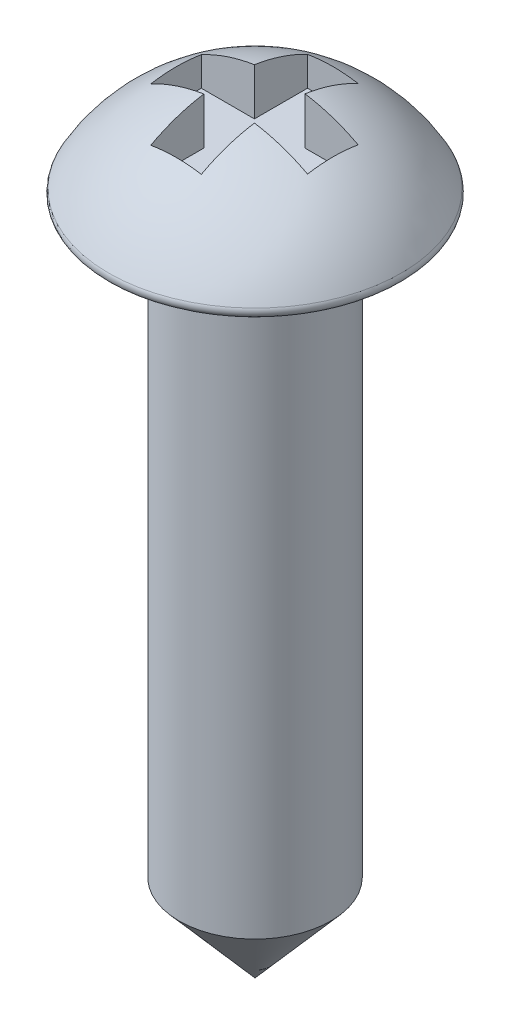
ISO-10303-21;
HEADER;
FILE_DESCRIPTION(('STEP AP214'),'2;1');
FILE_NAME('part.step','',(''),(''),'','','');
FILE_SCHEMA(('AUTOMOTIVE_DESIGN { 1 0 10303 214 1 1 1 1 }'));
ENDSEC;
DATA;
#1=APPLICATION_CONTEXT('core data for automotive mechanical design processes');
#2=APPLICATION_PROTOCOL_DEFINITION('international standard','automotive_design',2000,#1);
#3=PRODUCT_CONTEXT('',#1,'mechanical');
#4=PRODUCT('Part','Part','',(#3));
#5=PRODUCT_RELATED_PRODUCT_CATEGORY('part','',(#4));
#6=PRODUCT_DEFINITION_FORMATION('','',#4);
#7=PRODUCT_DEFINITION_CONTEXT('part definition',#1,'design');
#8=PRODUCT_DEFINITION('design','',#6,#7);
#9=PRODUCT_DEFINITION_SHAPE('','',#8);
#10=(LENGTH_UNIT() NAMED_UNIT(*) SI_UNIT(.MILLI.,.METRE.));
#11=(NAMED_UNIT(*) PLANE_ANGLE_UNIT() SI_UNIT($,.RADIAN.));
#12=(NAMED_UNIT(*) SI_UNIT($,.STERADIAN.) SOLID_ANGLE_UNIT());
#13=UNCERTAINTY_MEASURE_WITH_UNIT(LENGTH_MEASURE(1.E-05),#10,'distance_accuracy_value','');
#14=(GEOMETRIC_REPRESENTATION_CONTEXT(3) GLOBAL_UNCERTAINTY_ASSIGNED_CONTEXT((#13)) GLOBAL_UNIT_ASSIGNED_CONTEXT((#10,
#11,#12)) REPRESENTATION_CONTEXT('',''));
#15=CARTESIAN_POINT('',(0.,0.,0.));
#16=DIRECTION('',(0.,0.,1.));
#17=DIRECTION('',(1.,0.,0.));
#18=AXIS2_PLACEMENT_3D('',#15,#16,#17);
#19=CARTESIAN_POINT('',(0.,-9.7655291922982,0.));
#20=DIRECTION('',(0.,1.,0.));
#21=DIRECTION('',(0.,0.,1.));
#22=AXIS2_PLACEMENT_3D('',#19,#20,#21);
#23=CONICAL_SURFACE('',#22,0.,0.715536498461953);
#24=CARTESIAN_POINT('',(0.,-8.5,0.));
#25=DIRECTION('',(0.,1.,0.));
#26=DIRECTION('',(0.,0.,1.));
#27=AXIS2_PLACEMENT_3D('',#24,#25,#26);
#28=CIRCLE('',#27,1.1);
#29=CARTESIAN_POINT('',(0.,-8.5,1.1));
#30=VERTEX_POINT('',#29);
#31=EDGE_CURVE('E205',#30,#30,#28,.T.);
#32=ORIENTED_EDGE('',*,*,#31,.F.);
#33=EDGE_LOOP('',(#32));
#34=FACE_BOUND('',#33,.T.);
#35=CARTESIAN_POINT('',(0.,-9.7655291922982,0.));
#36=VERTEX_POINT('',#35);
#37=VERTEX_LOOP('',#36);
#38=FACE_BOUND('',#37,.T.);
#39=ADVANCED_FACE('F37',(#34,#38),#23,.T.);
#40=CARTESIAN_POINT('',(0.,3.8000547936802,0.));
#41=DIRECTION('',(0.,1.,0.));
#42=DIRECTION('',(0.,0.,1.));
#43=AXIS2_PLACEMENT_3D('',#40,#41,#42);
#44=CYLINDRICAL_SURFACE('',#43,1.1);
#45=CARTESIAN_POINT('',(0.,0.,0.));
#46=DIRECTION('',(0.,1.,0.));
#47=DIRECTION('',(0.,0.,1.));
#48=AXIS2_PLACEMENT_3D('',#45,#46,#47);
#49=CIRCLE('',#48,1.1);
#50=CARTESIAN_POINT('',(0.,0.,1.1));
#51=VERTEX_POINT('',#50);
#52=EDGE_CURVE('E174',#51,#51,#49,.T.);
#53=ORIENTED_EDGE('',*,*,#52,.F.);
#54=EDGE_LOOP('',(#53));
#55=FACE_BOUND('',#54,.T.);
#56=ORIENTED_EDGE('',*,*,#31,.T.);
#57=EDGE_LOOP('',(#56));
#58=FACE_BOUND('',#57,.T.);
#59=ADVANCED_FACE('F283',(#55,#58),#44,.T.);
#60=CARTESIAN_POINT('',(2.2,0.,0.));
#61=DIRECTION('',(0.,1.,0.));
#62=DIRECTION('',(0.,0.,1.));
#63=AXIS2_PLACEMENT_3D('',#60,#61,#62);
#64=PLANE('',#63);
#65=CARTESIAN_POINT('',(0.,0.,0.));
#66=DIRECTION('',(0.,1.,0.));
#67=DIRECTION('',(0.,0.,1.));
#68=AXIS2_PLACEMENT_3D('',#65,#66,#67);
#69=CIRCLE('',#68,2.0359463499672);
#70=CARTESIAN_POINT('',(0.,0.,2.0359463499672));
#71=VERTEX_POINT('',#70);
#72=EDGE_CURVE('E211',#71,#71,#69,.F.);
#73=ORIENTED_EDGE('',*,*,#72,.T.);
#74=EDGE_LOOP('',(#73));
#75=FACE_BOUND('',#74,.T.);
#76=ORIENTED_EDGE('',*,*,#52,.T.);
#77=EDGE_LOOP('',(#76));
#78=FACE_BOUND('',#77,.T.);
#79=ADVANCED_FACE('F288',(#75,#78),#64,.F.);
#80=CARTESIAN_POINT('',(0.,-1.04082556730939,0.));
#81=DIRECTION('',(0.,1.,0.));
#82=DIRECTION('',(1.,0.,0.));
#83=AXIS2_PLACEMENT_3D('',#80,#81,#82);
#84=SPHERICAL_SURFACE('',#83,2.43378673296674);
#85=CARTESIAN_POINT('',(0.,-1.04082556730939,0.370388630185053));
#86=DIRECTION('',(0.,0.,1.));
#87=DIRECTION('',(1.,0.,0.));
#88=AXIS2_PLACEMENT_3D('',#85,#86,#87);
#89=CIRCLE('',#88,2.40543761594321);
#90=CARTESIAN_POINT('',(1.13232028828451,1.08143287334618,0.370388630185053));
#91=VERTEX_POINT('',#90);
#92=CARTESIAN_POINT('',(0.361948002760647,1.33722484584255,0.370388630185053));
#93=VERTEX_POINT('',#92);
#94=EDGE_CURVE('E214',#91,#93,#89,.T.);
#95=ORIENTED_EDGE('',*,*,#94,.T.);
#96=CARTESIAN_POINT('',(0.361948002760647,-1.04082556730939,0.));
#97=DIRECTION('',(1.,0.,0.));
#98=DIRECTION('',(0.,0.,-1.));
#99=AXIS2_PLACEMENT_3D('',#96,#97,#98);
#100=CIRCLE('',#99,2.40672214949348);
#101=CARTESIAN_POINT('',(0.361948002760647,1.07836674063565,1.14076091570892));
#102=VERTEX_POINT('',#101);
#103=EDGE_CURVE('E11',#93,#102,#100,.T.);
#104=ORIENTED_EDGE('',*,*,#103,.T.);
#105=CARTESIAN_POINT('',(0.,-1.04082556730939,1.14076091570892));
#106=DIRECTION('',(0.,0.,1.));
#107=DIRECTION('',(1.,0.,0.));
#108=AXIS2_PLACEMENT_3D('',#105,#106,#107);
#109=CIRCLE('',#108,2.14987962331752);
#110=CARTESIAN_POINT('',(-0.371599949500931,1.07669559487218,1.14076091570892));
#111=VERTEX_POINT('',#110);
#112=EDGE_CURVE('E44',#102,#111,#109,.T.);
#113=ORIENTED_EDGE('',*,*,#112,.T.);
#114=CARTESIAN_POINT('',(-0.371599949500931,-1.04082556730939,0.));
#115=DIRECTION('',(-1.,0.,0.));
#116=DIRECTION('',(0.,0.,1.));
#117=AXIS2_PLACEMENT_3D('',#114,#115,#116);
#118=CIRCLE('',#117,2.40525078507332);
#119=CARTESIAN_POINT('',(-0.371599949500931,1.3357357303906,0.370388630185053));
#120=VERTEX_POINT('',#119);
#121=EDGE_CURVE('E240',#111,#120,#118,.T.);
#122=ORIENTED_EDGE('',*,*,#121,.T.);
#123=CARTESIAN_POINT('',(0.,-1.04082556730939,0.370388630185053));
#124=DIRECTION('',(0.,0.,1.));
#125=DIRECTION('',(1.,0.,0.));
#126=AXIS2_PLACEMENT_3D('',#123,#124,#125);
#127=CIRCLE('',#126,2.40543761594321);
#128=CARTESIAN_POINT('',(-1.14197223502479,1.07625486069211,0.370388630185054));
#129=VERTEX_POINT('',#128);
#130=EDGE_CURVE('E237',#120,#129,#127,.T.);
#131=ORIENTED_EDGE('',*,*,#130,.T.);
#132=CARTESIAN_POINT('',(-1.14197223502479,-1.04082556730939,0.));
#133=DIRECTION('',(-1.,0.,0.));
#134=DIRECTION('',(0.,0.,1.));
#135=AXIS2_PLACEMENT_3D('',#132,#133,#134);
#136=CIRCLE('',#135,2.14923644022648);
#137=CARTESIAN_POINT('',(-1.14197223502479,1.07750693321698,-0.363159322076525));
#138=VERTEX_POINT('',#137);
#139=EDGE_CURVE('E234',#129,#138,#136,.T.);
#140=ORIENTED_EDGE('',*,*,#139,.T.);
#141=CARTESIAN_POINT('',(0.,-1.04082556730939,-0.363159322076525));
#142=DIRECTION('',(0.,0.,-1.));
#143=DIRECTION('',(-1.,0.,0.));
#144=AXIS2_PLACEMENT_3D('',#141,#142,#143);
#145=CIRCLE('',#144,2.40653966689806);
#146=CARTESIAN_POINT('',(-0.371599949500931,1.33685116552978,-0.363159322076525));
#147=VERTEX_POINT('',#146);
#148=EDGE_CURVE('E231',#138,#147,#145,.T.);
#149=ORIENTED_EDGE('',*,*,#148,.T.);
#150=CARTESIAN_POINT('',(-0.371599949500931,-1.04082556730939,0.));
#151=DIRECTION('',(-1.,0.,0.));
#152=DIRECTION('',(0.,0.,1.));
#153=AXIS2_PLACEMENT_3D('',#150,#151,#152);
#154=CIRCLE('',#153,2.40525078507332);
#155=CARTESIAN_POINT('',(-0.371599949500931,1.08057430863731,-1.13353160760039));
#156=VERTEX_POINT('',#155);
#157=EDGE_CURVE('E228',#147,#156,#154,.T.);
#158=ORIENTED_EDGE('',*,*,#157,.T.);
#159=CARTESIAN_POINT('',(0.,-1.04082556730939,-1.13353160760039));
#160=DIRECTION('',(0.,0.,-1.));
#161=DIRECTION('',(-1.,0.,0.));
#162=AXIS2_PLACEMENT_3D('',#159,#160,#161);
#163=CIRCLE('',#162,2.15370006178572);
#164=CARTESIAN_POINT('',(0.361948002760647,1.08224240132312,-1.13353160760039));
#165=VERTEX_POINT('',#164);
#166=EDGE_CURVE('E225',#156,#165,#163,.T.);
#167=ORIENTED_EDGE('',*,*,#166,.T.);
#168=CARTESIAN_POINT('',(0.361948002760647,-1.04082556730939,0.));
#169=DIRECTION('',(1.,0.,0.));
#170=DIRECTION('',(0.,0.,-1.));
#171=AXIS2_PLACEMENT_3D('',#168,#169,#170);
#172=CIRCLE('',#171,2.40672214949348);
#173=CARTESIAN_POINT('',(0.361948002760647,1.33833958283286,-0.363159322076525));
#174=VERTEX_POINT('',#173);
#175=EDGE_CURVE('E222',#165,#174,#172,.T.);
#176=ORIENTED_EDGE('',*,*,#175,.T.);
#177=CARTESIAN_POINT('',(0.,-1.04082556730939,-0.363159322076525));
#178=DIRECTION('',(0.,0.,-1.));
#179=DIRECTION('',(-1.,0.,0.));
#180=AXIS2_PLACEMENT_3D('',#177,#178,#179);
#181=CIRCLE('',#180,2.40653966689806);
#182=CARTESIAN_POINT('',(1.13232028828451,1.0826818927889,-0.363159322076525));
#183=VERTEX_POINT('',#182);
#184=EDGE_CURVE('E219',#174,#183,#181,.T.);
#185=ORIENTED_EDGE('',*,*,#184,.T.);
#186=CARTESIAN_POINT('',(1.13232028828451,-1.04082556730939,0.));
#187=DIRECTION('',(1.,0.,0.));
#188=DIRECTION('',(0.,0.,-1.));
#189=AXIS2_PLACEMENT_3D('',#186,#187,#188);
#190=CIRCLE('',#189,2.15433716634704);
#191=EDGE_CURVE('E216',#183,#91,#190,.T.);
#192=ORIENTED_EDGE('',*,*,#191,.T.);
#193=EDGE_LOOP('',(#95,#104,#113,#122,#131,#140,#149,#158,#167,#176,#185,#192));
#194=FACE_BOUND('',#193,.T.);
#195=CARTESIAN_POINT('',(0.,0.148883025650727,0.));
#196=DIRECTION('',(0.,-1.,0.));
#197=DIRECTION('',(0.,0.,-1.));
#198=AXIS2_PLACEMENT_3D('',#195,#196,#197);
#199=CIRCLE('',#198,2.12318424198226);
#200=CARTESIAN_POINT('',(0.,0.148883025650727,-2.12318424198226));
#201=VERTEX_POINT('',#200);
#202=EDGE_CURVE('E208',#201,#201,#199,.F.);
#203=ORIENTED_EDGE('',*,*,#202,.T.);
#204=EDGE_LOOP('',(#203));
#205=FACE_BOUND('',#204,.T.);
#206=ADVANCED_FACE('F244',(#194,#205),#84,.T.);
#207=CARTESIAN_POINT('',(0.,0.1,0.));
#208=DIRECTION('',(0.,1.,0.));
#209=DIRECTION('',(0.,0.,1.));
#210=AXIS2_PLACEMENT_3D('',#207,#208,#209);
#211=TOROIDAL_SURFACE('',#210,2.0359463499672,0.1);
#212=ORIENTED_EDGE('',*,*,#72,.F.);
#213=EDGE_LOOP('',(#212));
#214=FACE_BOUND('',#213,.T.);
#215=ORIENTED_EDGE('',*,*,#202,.F.);
#216=EDGE_LOOP('',(#215));
#217=FACE_BOUND('',#216,.T.);
#218=ADVANCED_FACE('F301',(#214,#217),#211,.T.);
#219=CARTESIAN_POINT('',(0.361948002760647,0.656537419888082,1.14076091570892));
#220=DIRECTION('',(1.,0.,0.));
#221=DIRECTION('',(0.,0.,-1.));
#222=AXIS2_PLACEMENT_3D('',#219,#220,#221);
#223=PLANE('',#222);
#224=DIRECTION('',(0.,1.,0.));
#225=VECTOR('',#224,1.);
#226=CARTESIAN_POINT('',(0.361948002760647,0.656537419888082,0.370388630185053));
#227=LINE('',#226,#225);
#228=CARTESIAN_POINT('',(0.361948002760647,0.656537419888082,0.370388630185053));
#229=VERTEX_POINT('',#228);
#230=EDGE_CURVE('E51',#229,#93,#227,.T.);
#231=ORIENTED_EDGE('',*,*,#230,.F.);
#232=DIRECTION('',(0.,0.,-1.));
#233=VECTOR('',#232,1.);
#234=CARTESIAN_POINT('',(0.361948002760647,0.656537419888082,1.14076091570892));
#235=LINE('',#234,#233);
#236=CARTESIAN_POINT('',(0.361948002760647,0.656537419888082,1.14076091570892));
#237=VERTEX_POINT('',#236);
#238=EDGE_CURVE('E127',#237,#229,#235,.T.);
#239=ORIENTED_EDGE('',*,*,#238,.F.);
#240=DIRECTION('',(0.,1.,0.));
#241=VECTOR('',#240,1.);
#242=CARTESIAN_POINT('',(0.361948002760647,0.656537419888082,1.14076091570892));
#243=LINE('',#242,#241);
#244=EDGE_CURVE('E172',#237,#102,#243,.T.);
#245=ORIENTED_EDGE('',*,*,#244,.T.);
#246=ORIENTED_EDGE('',*,*,#103,.F.);
#247=EDGE_LOOP('',(#231,#239,#245,#246));
#248=FACE_BOUND('',#247,.T.);
#249=ADVANCED_FACE('F124',(#248),#223,.F.);
#250=CARTESIAN_POINT('',(0.361948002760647,0.656537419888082,1.14076091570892));
#251=DIRECTION('',(0.,0.,1.));
#252=DIRECTION('',(1.,0.,0.));
#253=AXIS2_PLACEMENT_3D('',#250,#251,#252);
#254=PLANE('',#253);
#255=ORIENTED_EDGE('',*,*,#244,.F.);
#256=DIRECTION('',(1.,0.,0.));
#257=VECTOR('',#256,1.);
#258=CARTESIAN_POINT('',(0.361948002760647,0.656537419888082,1.14076091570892));
#259=LINE('',#258,#257);
#260=CARTESIAN_POINT('',(-0.371599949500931,0.656537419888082,1.14076091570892));
#261=VERTEX_POINT('',#260);
#262=EDGE_CURVE('E131',#261,#237,#259,.T.);
#263=ORIENTED_EDGE('',*,*,#262,.F.);
#264=DIRECTION('',(0.,1.,0.));
#265=VECTOR('',#264,1.);
#266=CARTESIAN_POINT('',(-0.371599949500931,0.656537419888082,1.14076091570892));
#267=LINE('',#266,#265);
#268=EDGE_CURVE('E175',#261,#111,#267,.T.);
#269=ORIENTED_EDGE('',*,*,#268,.T.);
#270=ORIENTED_EDGE('',*,*,#112,.F.);
#271=EDGE_LOOP('',(#255,#263,#269,#270));
#272=FACE_BOUND('',#271,.T.);
#273=ADVANCED_FACE('F247',(#272),#254,.F.);
#274=CARTESIAN_POINT('',(-0.371599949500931,0.656537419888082,1.14076091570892));
#275=DIRECTION('',(-1.,0.,0.));
#276=DIRECTION('',(0.,0.,1.));
#277=AXIS2_PLACEMENT_3D('',#274,#275,#276);
#278=PLANE('',#277);
#279=ORIENTED_EDGE('',*,*,#268,.F.);
#280=DIRECTION('',(0.,0.,1.));
#281=VECTOR('',#280,1.);
#282=CARTESIAN_POINT('',(-0.371599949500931,0.656537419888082,1.14076091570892));
#283=LINE('',#282,#281);
#284=CARTESIAN_POINT('',(-0.371599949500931,0.656537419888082,0.370388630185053));
#285=VERTEX_POINT('',#284);
#286=EDGE_CURVE('E169',#285,#261,#283,.T.);
#287=ORIENTED_EDGE('',*,*,#286,.F.);
#288=DIRECTION('',(0.,1.,0.));
#289=VECTOR('',#288,1.);
#290=CARTESIAN_POINT('',(-0.371599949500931,0.656537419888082,0.370388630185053));
#291=LINE('',#290,#289);
#292=EDGE_CURVE('E178',#285,#120,#291,.T.);
#293=ORIENTED_EDGE('',*,*,#292,.T.);
#294=ORIENTED_EDGE('',*,*,#121,.F.);
#295=EDGE_LOOP('',(#279,#287,#293,#294));
#296=FACE_BOUND('',#295,.T.);
#297=ADVANCED_FACE('F250',(#296),#278,.F.);
#298=CARTESIAN_POINT('',(-0.371599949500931,0.656537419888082,0.370388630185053));
#299=DIRECTION('',(0.,0.,1.));
#300=DIRECTION('',(1.,0.,0.));
#301=AXIS2_PLACEMENT_3D('',#298,#299,#300);
#302=PLANE('',#301);
#303=ORIENTED_EDGE('',*,*,#292,.F.);
#304=DIRECTION('',(1.,0.,0.));
#305=VECTOR('',#304,1.);
#306=CARTESIAN_POINT('',(-0.371599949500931,0.656537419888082,0.370388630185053));
#307=LINE('',#306,#305);
#308=CARTESIAN_POINT('',(-1.14197223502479,0.656537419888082,0.370388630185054));
#309=VERTEX_POINT('',#308);
#310=EDGE_CURVE('E166',#309,#285,#307,.T.);
#311=ORIENTED_EDGE('',*,*,#310,.F.);
#312=DIRECTION('',(0.,1.,0.));
#313=VECTOR('',#312,1.);
#314=CARTESIAN_POINT('',(-1.14197223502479,0.656537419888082,0.370388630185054));
#315=LINE('',#314,#313);
#316=EDGE_CURVE('E181',#309,#129,#315,.T.);
#317=ORIENTED_EDGE('',*,*,#316,.T.);
#318=ORIENTED_EDGE('',*,*,#130,.F.);
#319=EDGE_LOOP('',(#303,#311,#317,#318));
#320=FACE_BOUND('',#319,.T.);
#321=ADVANCED_FACE('F254',(#320),#302,.F.);
#322=CARTESIAN_POINT('',(-1.14197223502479,0.656537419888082,0.370388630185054));
#323=DIRECTION('',(-1.,0.,0.));
#324=DIRECTION('',(0.,0.,1.));
#325=AXIS2_PLACEMENT_3D('',#322,#323,#324);
#326=PLANE('',#325);
#327=ORIENTED_EDGE('',*,*,#316,.F.);
#328=DIRECTION('',(0.,0.,1.));
#329=VECTOR('',#328,1.);
#330=CARTESIAN_POINT('',(-1.14197223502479,0.656537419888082,0.370388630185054));
#331=LINE('',#330,#329);
#332=CARTESIAN_POINT('',(-1.14197223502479,0.656537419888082,-0.363159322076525));
#333=VERTEX_POINT('',#332);
#334=EDGE_CURVE('E163',#333,#309,#331,.T.);
#335=ORIENTED_EDGE('',*,*,#334,.F.);
#336=DIRECTION('',(0.,1.,0.));
#337=VECTOR('',#336,1.);
#338=CARTESIAN_POINT('',(-1.14197223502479,0.656537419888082,-0.363159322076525));
#339=LINE('',#338,#337);
#340=EDGE_CURVE('E184',#333,#138,#339,.T.);
#341=ORIENTED_EDGE('',*,*,#340,.T.);
#342=ORIENTED_EDGE('',*,*,#139,.F.);
#343=EDGE_LOOP('',(#327,#335,#341,#342));
#344=FACE_BOUND('',#343,.T.);
#345=ADVANCED_FACE('F256',(#344),#326,.F.);
#346=CARTESIAN_POINT('',(-0.371599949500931,0.656537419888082,-0.363159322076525));
#347=DIRECTION('',(0.,0.,-1.));
#348=DIRECTION('',(-1.,0.,0.));
#349=AXIS2_PLACEMENT_3D('',#346,#347,#348);
#350=PLANE('',#349);
#351=ORIENTED_EDGE('',*,*,#340,.F.);
#352=DIRECTION('',(-1.,0.,0.));
#353=VECTOR('',#352,1.);
#354=CARTESIAN_POINT('',(-0.371599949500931,0.656537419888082,-0.363159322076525));
#355=LINE('',#354,#353);
#356=CARTESIAN_POINT('',(-0.371599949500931,0.656537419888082,-0.363159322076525));
#357=VERTEX_POINT('',#356);
#358=EDGE_CURVE('E160',#357,#333,#355,.T.);
#359=ORIENTED_EDGE('',*,*,#358,.F.);
#360=DIRECTION('',(0.,1.,0.));
#361=VECTOR('',#360,1.);
#362=CARTESIAN_POINT('',(-0.371599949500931,0.656537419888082,-0.363159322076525));
#363=LINE('',#362,#361);
#364=EDGE_CURVE('E187',#357,#147,#363,.T.);
#365=ORIENTED_EDGE('',*,*,#364,.T.);
#366=ORIENTED_EDGE('',*,*,#148,.F.);
#367=EDGE_LOOP('',(#351,#359,#365,#366));
#368=FACE_BOUND('',#367,.T.);
#369=ADVANCED_FACE('F259',(#368),#350,.F.);
#370=CARTESIAN_POINT('',(-0.371599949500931,0.656537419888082,-0.363159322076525));
#371=DIRECTION('',(-1.,0.,0.));
#372=DIRECTION('',(0.,0.,1.));
#373=AXIS2_PLACEMENT_3D('',#370,#371,#372);
#374=PLANE('',#373);
#375=ORIENTED_EDGE('',*,*,#364,.F.);
#376=DIRECTION('',(0.,0.,1.));
#377=VECTOR('',#376,1.);
#378=CARTESIAN_POINT('',(-0.371599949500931,0.656537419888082,-0.363159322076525));
#379=LINE('',#378,#377);
#380=CARTESIAN_POINT('',(-0.371599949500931,0.656537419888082,-1.13353160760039));
#381=VERTEX_POINT('',#380);
#382=EDGE_CURVE('E157',#381,#357,#379,.T.);
#383=ORIENTED_EDGE('',*,*,#382,.F.);
#384=DIRECTION('',(0.,1.,0.));
#385=VECTOR('',#384,1.);
#386=CARTESIAN_POINT('',(-0.371599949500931,0.656537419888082,-1.13353160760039));
#387=LINE('',#386,#385);
#388=EDGE_CURVE('E190',#381,#156,#387,.T.);
#389=ORIENTED_EDGE('',*,*,#388,.T.);
#390=ORIENTED_EDGE('',*,*,#157,.F.);
#391=EDGE_LOOP('',(#375,#383,#389,#390));
#392=FACE_BOUND('',#391,.T.);
#393=ADVANCED_FACE('F262',(#392),#374,.F.);
#394=CARTESIAN_POINT('',(0.361948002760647,0.656537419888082,-1.13353160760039));
#395=DIRECTION('',(0.,0.,-1.));
#396=DIRECTION('',(-1.,0.,0.));
#397=AXIS2_PLACEMENT_3D('',#394,#395,#396);
#398=PLANE('',#397);
#399=ORIENTED_EDGE('',*,*,#388,.F.);
#400=DIRECTION('',(-1.,0.,0.));
#401=VECTOR('',#400,1.);
#402=CARTESIAN_POINT('',(0.361948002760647,0.656537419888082,-1.13353160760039));
#403=LINE('',#402,#401);
#404=CARTESIAN_POINT('',(0.361948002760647,0.656537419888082,-1.13353160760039));
#405=VERTEX_POINT('',#404);
#406=EDGE_CURVE('E154',#405,#381,#403,.T.);
#407=ORIENTED_EDGE('',*,*,#406,.F.);
#408=DIRECTION('',(0.,1.,0.));
#409=VECTOR('',#408,1.);
#410=CARTESIAN_POINT('',(0.361948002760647,0.656537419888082,-1.13353160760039));
#411=LINE('',#410,#409);
#412=EDGE_CURVE('E193',#405,#165,#411,.T.);
#413=ORIENTED_EDGE('',*,*,#412,.T.);
#414=ORIENTED_EDGE('',*,*,#166,.F.);
#415=EDGE_LOOP('',(#399,#407,#413,#414));
#416=FACE_BOUND('',#415,.T.);
#417=ADVANCED_FACE('F264',(#416),#398,.F.);
#418=CARTESIAN_POINT('',(0.361948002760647,0.656537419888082,-0.363159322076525));
#419=DIRECTION('',(1.,0.,0.));
#420=DIRECTION('',(0.,0.,-1.));
#421=AXIS2_PLACEMENT_3D('',#418,#419,#420);
#422=PLANE('',#421);
#423=ORIENTED_EDGE('',*,*,#412,.F.);
#424=DIRECTION('',(0.,0.,-1.));
#425=VECTOR('',#424,1.);
#426=CARTESIAN_POINT('',(0.361948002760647,0.656537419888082,-0.363159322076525));
#427=LINE('',#426,#425);
#428=CARTESIAN_POINT('',(0.361948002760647,0.656537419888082,-0.363159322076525));
#429=VERTEX_POINT('',#428);
#430=EDGE_CURVE('E151',#429,#405,#427,.T.);
#431=ORIENTED_EDGE('',*,*,#430,.F.);
#432=DIRECTION('',(0.,1.,0.));
#433=VECTOR('',#432,1.);
#434=CARTESIAN_POINT('',(0.361948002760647,0.656537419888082,-0.363159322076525));
#435=LINE('',#434,#433);
#436=EDGE_CURVE('E196',#429,#174,#435,.T.);
#437=ORIENTED_EDGE('',*,*,#436,.T.);
#438=ORIENTED_EDGE('',*,*,#175,.F.);
#439=EDGE_LOOP('',(#423,#431,#437,#438));
#440=FACE_BOUND('',#439,.T.);
#441=ADVANCED_FACE('F268',(#440),#422,.F.);
#442=CARTESIAN_POINT('',(1.13232028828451,0.656537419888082,-0.363159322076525));
#443=DIRECTION('',(0.,0.,-1.));
#444=DIRECTION('',(-1.,0.,0.));
#445=AXIS2_PLACEMENT_3D('',#442,#443,#444);
#446=PLANE('',#445);
#447=ORIENTED_EDGE('',*,*,#436,.F.);
#448=DIRECTION('',(-1.,0.,0.));
#449=VECTOR('',#448,1.);
#450=CARTESIAN_POINT('',(1.13232028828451,0.656537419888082,-0.363159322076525));
#451=LINE('',#450,#449);
#452=CARTESIAN_POINT('',(1.13232028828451,0.656537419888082,-0.363159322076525));
#453=VERTEX_POINT('',#452);
#454=EDGE_CURVE('E148',#453,#429,#451,.T.);
#455=ORIENTED_EDGE('',*,*,#454,.F.);
#456=DIRECTION('',(0.,1.,0.));
#457=VECTOR('',#456,1.);
#458=CARTESIAN_POINT('',(1.13232028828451,0.656537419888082,-0.363159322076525));
#459=LINE('',#458,#457);
#460=EDGE_CURVE('E199',#453,#183,#459,.T.);
#461=ORIENTED_EDGE('',*,*,#460,.T.);
#462=ORIENTED_EDGE('',*,*,#184,.F.);
#463=EDGE_LOOP('',(#447,#455,#461,#462));
#464=FACE_BOUND('',#463,.T.);
#465=ADVANCED_FACE('F271',(#464),#446,.F.);
#466=CARTESIAN_POINT('',(1.13232028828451,0.656537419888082,0.370388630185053));
#467=DIRECTION('',(1.,0.,0.));
#468=DIRECTION('',(0.,0.,-1.));
#469=AXIS2_PLACEMENT_3D('',#466,#467,#468);
#470=PLANE('',#469);
#471=ORIENTED_EDGE('',*,*,#460,.F.);
#472=DIRECTION('',(0.,0.,-1.));
#473=VECTOR('',#472,1.);
#474=CARTESIAN_POINT('',(1.13232028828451,0.656537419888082,0.370388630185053));
#475=LINE('',#474,#473);
#476=CARTESIAN_POINT('',(1.13232028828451,0.656537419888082,0.370388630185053));
#477=VERTEX_POINT('',#476);
#478=EDGE_CURVE('E140',#477,#453,#475,.T.);
#479=ORIENTED_EDGE('',*,*,#478,.F.);
#480=DIRECTION('',(0.,1.,0.));
#481=VECTOR('',#480,1.);
#482=CARTESIAN_POINT('',(1.13232028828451,0.656537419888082,0.370388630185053));
#483=LINE('',#482,#481);
#484=EDGE_CURVE('E130',#477,#91,#483,.T.);
#485=ORIENTED_EDGE('',*,*,#484,.T.);
#486=ORIENTED_EDGE('',*,*,#191,.F.);
#487=EDGE_LOOP('',(#471,#479,#485,#486));
#488=FACE_BOUND('',#487,.T.);
#489=ADVANCED_FACE('F273',(#488),#470,.F.);
#490=CARTESIAN_POINT('',(1.13232028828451,0.656537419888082,0.370388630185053));
#491=DIRECTION('',(0.,0.,1.));
#492=DIRECTION('',(1.,0.,0.));
#493=AXIS2_PLACEMENT_3D('',#490,#491,#492);
#494=PLANE('',#493);
#495=ORIENTED_EDGE('',*,*,#484,.F.);
#496=DIRECTION('',(1.,0.,0.));
#497=VECTOR('',#496,1.);
#498=CARTESIAN_POINT('',(1.13232028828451,0.656537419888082,0.370388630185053));
#499=LINE('',#498,#497);
#500=EDGE_CURVE('E134',#229,#477,#499,.T.);
#501=ORIENTED_EDGE('',*,*,#500,.F.);
#502=ORIENTED_EDGE('',*,*,#230,.T.);
#503=ORIENTED_EDGE('',*,*,#94,.F.);
#504=EDGE_LOOP('',(#495,#501,#502,#503));
#505=FACE_BOUND('',#504,.T.);
#506=ADVANCED_FACE('F135',(#505),#494,.F.);
#507=CARTESIAN_POINT('',(0.361948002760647,0.656537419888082,-1.13353160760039));
#508=DIRECTION('',(0.,1.,0.));
#509=DIRECTION('',(0.,0.,1.));
#510=AXIS2_PLACEMENT_3D('',#507,#508,#509);
#511=PLANE('',#510);
#512=ORIENTED_EDGE('',*,*,#238,.T.);
#513=ORIENTED_EDGE('',*,*,#500,.T.);
#514=ORIENTED_EDGE('',*,*,#478,.T.);
#515=ORIENTED_EDGE('',*,*,#454,.T.);
#516=ORIENTED_EDGE('',*,*,#430,.T.);
#517=ORIENTED_EDGE('',*,*,#406,.T.);
#518=ORIENTED_EDGE('',*,*,#382,.T.);
#519=ORIENTED_EDGE('',*,*,#358,.T.);
#520=ORIENTED_EDGE('',*,*,#334,.T.);
#521=ORIENTED_EDGE('',*,*,#310,.T.);
#522=ORIENTED_EDGE('',*,*,#286,.T.);
#523=ORIENTED_EDGE('',*,*,#262,.T.);
#524=EDGE_LOOP('',(#512,#513,#514,#515,#516,#517,#518,#519,#520,#521,#522,#523));
#525=FACE_BOUND('',#524,.T.);
#526=ADVANCED_FACE('F142',(#525),#511,.T.);
#527=CLOSED_SHELL('',(#39,#59,#79,#206,#218,#249,#273,#297,#321,#345,#369,#393,#417,#441,#465,
#489,#506,#526));
#528=MANIFOLD_SOLID_BREP('B2',#527);
#529=ADVANCED_BREP_SHAPE_REPRESENTATION('',(#18,#528),#14);
#530=SHAPE_DEFINITION_REPRESENTATION(#9,#529);
ENDSEC;
END-ISO-10303-21;
